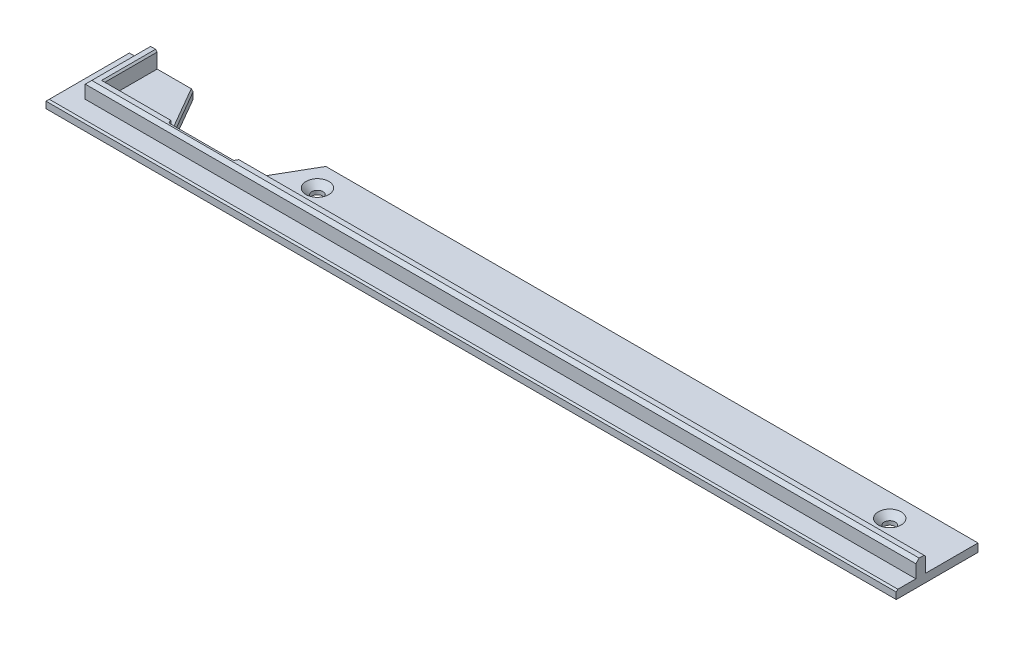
from build123d import *

# Parameters (mm, degrees)
SKIZZE1_W                                   = 260
SKIZZE1_H                                   = 25
AUFSATZ_LINEAR_AUSTRAGEN1_DEPTH             = 3
AUFSATZ_LINEAR_AUSTRAGEN2_DEPTH             = 5
FASE1_SIZE                                  = 0.5
FASE2_SIZE                                  = 1
FORMSENKUNG_F_R_M3_SENKSCHRAUBE_MIT_2_COUNT = 2
FORMSENKUNG_F_R_M3_SENKSCHRAUBE_MIT_2_PITCH = 175
SCHNITT_LINEAR_AUSTRAGEN1_DEPTH             = 131.695256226
SCHNITT_LINEAR_AUSTRAGEN1_DEPTH_BACK        = 131.695256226
FASE3_SIZE                                  = 0.5


with BuildPart() as part:
    # Skizze1 → Aufsatz-Linear austragen1 (new body)
    with BuildSketch(Plane(origin=(0, 0, 0), x_dir=(1, 0, 0), z_dir=(0, 1, 0))):
        Rectangle(SKIZZE1_W, SKIZZE1_H)
    extrude(amount=AUFSATZ_LINEAR_AUSTRAGEN1_DEPTH)

    # Skizze2 → Aufsatz-Linear austragen2 (add)
    with BuildSketch(Plane(origin=(0, 3, 0), x_dir=(1, 0, 0), z_dir=(0, 1, 0))):
        Polygon((-121, -3.5), (130, -3.5), (130, -6.5), (-124, -6.5), (-124, 12.5), (-121, 12.5), align=None)
    extrude(amount=AUFSATZ_LINEAR_AUSTRAGEN2_DEPTH)

    # Fase1
    fase1_edges = [part.edges().sort_by_distance(p)[0] for p in [
        (-130, 3, 0),
        (0, 3, 12.5),
        (-121, 8, -4.5),
        (4.5, 8, 3.5),
        (0, 0, 12.5),
        (-130, 0, 0),
        (0, 0, -12.5),
        (130, 0, 0),
    ]]
    chamfer(fase1_edges, length=FASE1_SIZE)

    # Fase2
    fase2_edges = [part.edges().sort_by_distance(p)[0] for p in [
        (-124, 8, -3),
        (3, 8, 6.5),
    ]]
    chamfer(fase2_edges, length=FASE2_SIZE)

    # Skizze4 → Formsenkung f_r M3 Senkschraube mit Inne (revolve, cut)
    with BuildSketch(Plane(origin=(110, 3, -5.5), x_dir=(0, 0, 1), z_dir=(1, 0, 0))):
        Polygon((0, 0), (0, 3), (1.7, 3), (1.7, 1.8), (3.5, 0), align=None)
    formsenkung_f_r_m3_senkschraube_mit_inne = revolve(axis=Axis((110, 9.35, -5.5), (0, -1, 0)), mode=Mode.SUBTRACT)

    # Formsenkung f_r M3 Senkschraube mit  2: Formsenkung f_r M3 Senkschraube mit Inne ×2
    with Locations(*[(-i * FORMSENKUNG_F_R_M3_SENKSCHRAUBE_MIT_2_PITCH, 0, 0) for i in range(1, FORMSENKUNG_F_R_M3_SENKSCHRAUBE_MIT_2_COUNT)]):
        add(formsenkung_f_r_m3_senkschraube_mit_inne, mode=Mode.SUBTRACT)

    # Skizze5 → Schnitt-Linear austragen1 (cut, two sides: drawn at the far end of the back side and taken through both)
    with BuildSketch(Plane(origin=(0, 3, 0), x_dir=(1, 0, 0), z_dir=(0, 1, 0)).offset(-SCHNITT_LINEAR_AUSTRAGEN1_DEPTH_BACK)):
        Polygon((-110, 12.5), (-99.896370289, -5), (-80.103629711, -5), (-70, 12.5), align=None)
    extrude(amount=SCHNITT_LINEAR_AUSTRAGEN1_DEPTH + SCHNITT_LINEAR_AUSTRAGEN1_DEPTH_BACK, mode=Mode.SUBTRACT)

    # Fase3
    fase3_edges = [part.edges().sort_by_distance(p)[0] for p in [
        (-105.381197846, 3, -4.5),
        (-74.618802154, 3, -4.5),
        (-75.196152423, 0, -3.5),
        (-90, 0, 5),
        (-104.803847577, 0, -3.5),
    ]]
    chamfer(fase3_edges, length=FASE3_SIZE)


solid = part.part
